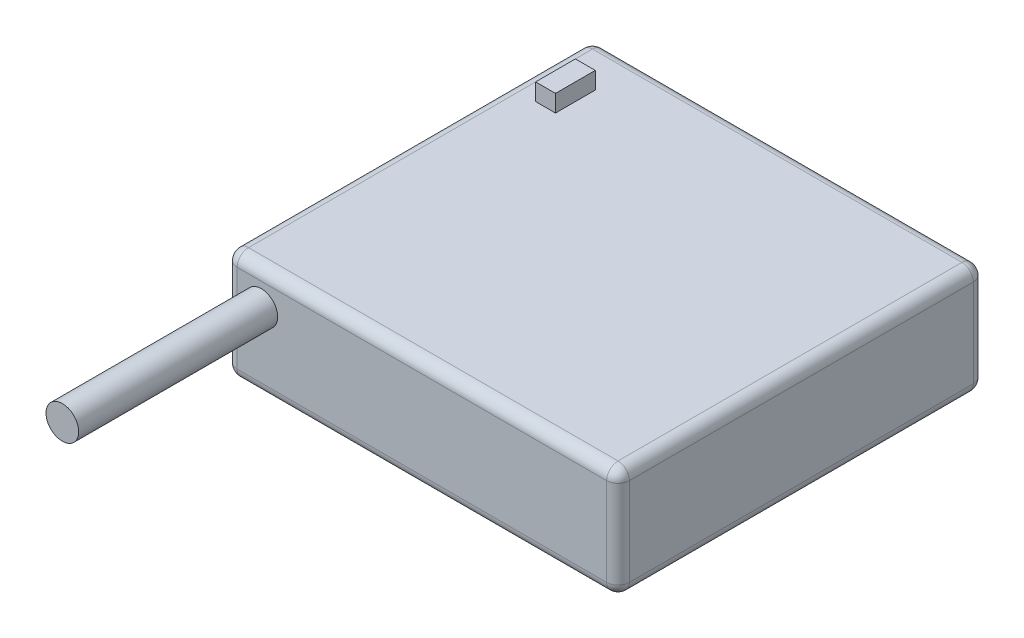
from build123d import *

# Parameters (mm, degrees)
SKETCH1_W           = 64.5
SKETCH1_H           = 19.5
BOSS_EXTRUDE1_DEPTH = 69
FILLET1_R           = 2
FILLET2_R           = 2
SKETCH2_R           = 2.875
BOSS_EXTRUDE2_DEPTH = 35
SKETCH3_W           = 3.5
SKETCH3_H           = 7
BOSS_EXTRUDE3_DEPTH = 3


with BuildPart() as part:
    # Sketch1 → Boss-Extrude1 (new body)
    with BuildSketch(Plane(origin=(0, 0, 0), x_dir=(0, 0, -1), z_dir=(1, 0, 0))):
        with Locations((32.25, 9.75)):
            Rectangle(SKETCH1_W, SKETCH1_H)
    extrude(amount=BOSS_EXTRUDE1_DEPTH)

    # Fillet1
    fillet1_edges = [part.edges().sort_by_distance(p)[0] for p in [
        (34.5, 19.5, 0),
        (34.5, 19.5, -64.5),
        (34.5, 0, -64.5),
        (34.5, 0, 0),
    ]]
    fillet(fillet1_edges, radius=FILLET1_R)

    # Fillet2
    fillet2_edges = [part.edges().sort_by_distance(p)[0] for p in [
        (0, 0, -32.25),
        (69, 0, -32.25),
        (0, 9.75, 0),
        (0, 19.5, -32.25),
        (0, 9.75, -64.5),
        (0, 18.914213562, -63.914213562),
        (0, 0.585786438, -63.914213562),
        (0, 18.914213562, -0.585786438),
        (0, 0.585786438, -0.585786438),
        (69, 9.75, 0),
        (69, 9.75, -64.5),
        (69, 19.5, -32.25),
        (69, 18.914213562, -63.914213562),
        (69, 0.585786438, -63.914213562),
        (69, 18.914213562, -0.585786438),
        (69, 0.585786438, -0.585786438),
    ]]
    fillet(fillet2_edges, radius=FILLET2_R)

    # Sketch2 → Boss-Extrude2 (add)
    with BuildSketch(Plane.XY):
        with Locations(Location((6.25, 13.5, 0), (0, 0, 180))):
            Circle(SKETCH2_R)
    extrude(amount=BOSS_EXTRUDE2_DEPTH)

    # Sketch3 → Boss-Extrude3 (add)
    with BuildSketch(Plane(origin=(0, 19.5, 0), x_dir=(1, 0, 0), z_dir=(0, 1, 0))):
        with Locations((6.75, 53)):
            Rectangle(SKETCH3_W, SKETCH3_H)
    extrude(amount=BOSS_EXTRUDE3_DEPTH)


solid = part.part
